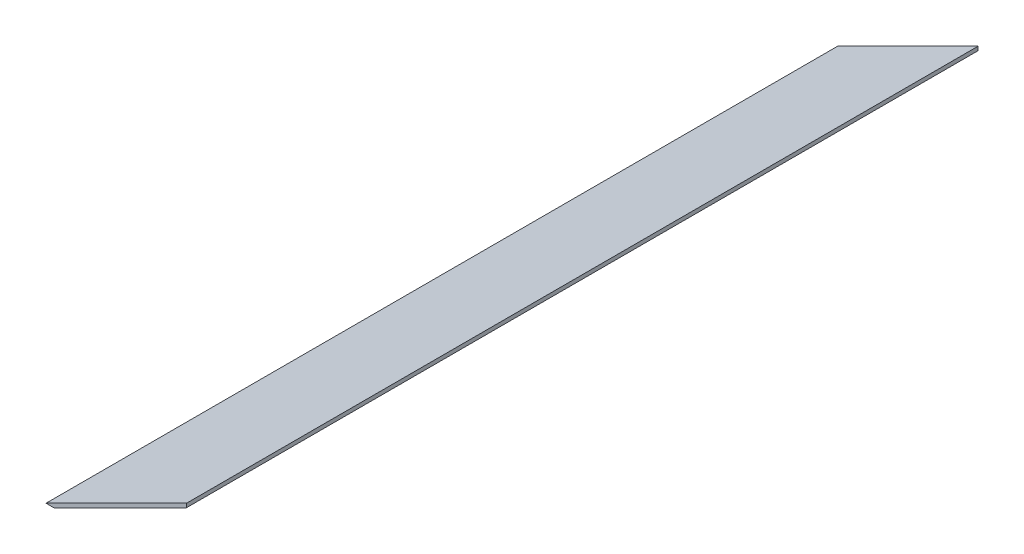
from build123d import *

# Parameters (mm, degrees)
EXTRUDE_1_DEPTH = 226


with BuildPart() as part:
    # Sketch 2 → Extrude 1 (new body)
    with BuildSketch(Plane.XY):
        Polygon((-28.922155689, -11.25748503), (11.185618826, 8.796402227), (11.185618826, 7.678368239), (-26.686087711, -11.25748503), align=None)
    extrude(amount=EXTRUDE_1_DEPTH)


solid = part.part
